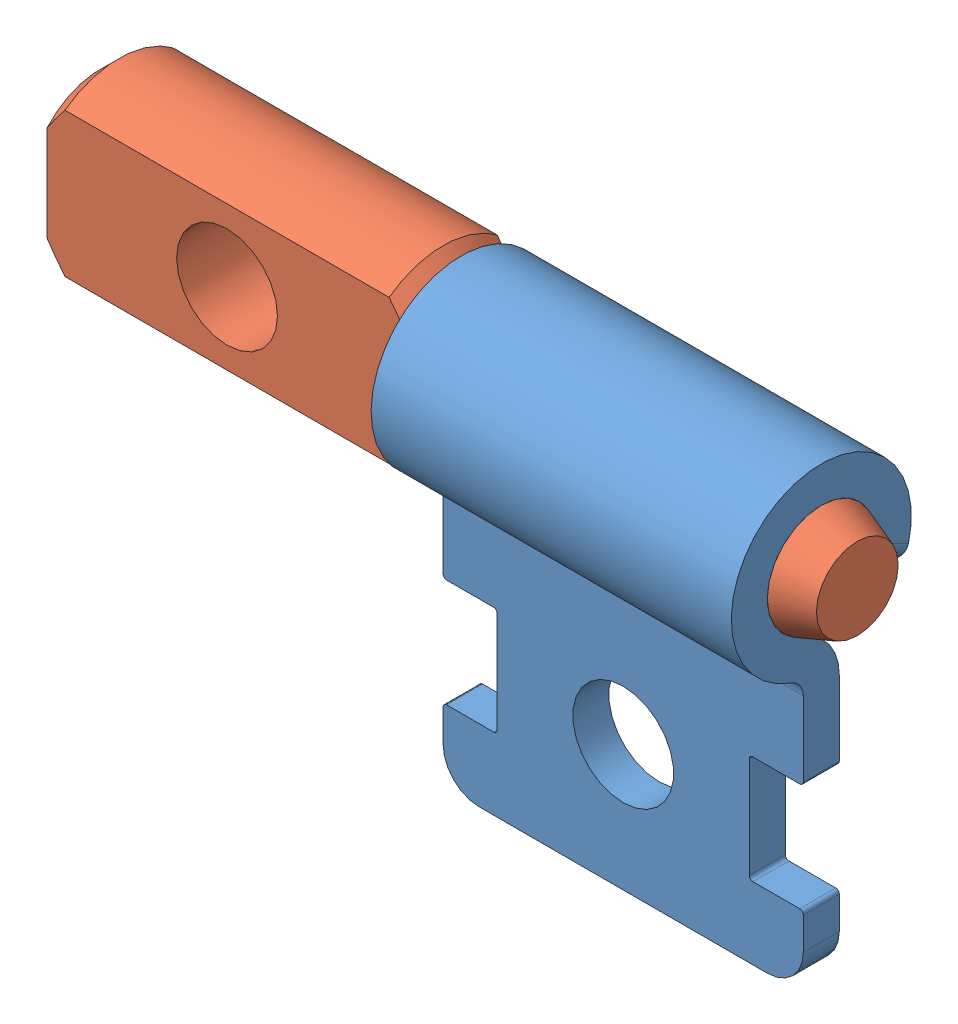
SolidWorks assembly ST040A0.SLDASM, configuration Default (file format 7000). Lengths in mm.
Overall size (21 12.5 5).
2 component instances, 2 part files, 3 mates.
Components (placement in the parent):
- ST040 Bracket-1: ST040 Bracket.SLDPRT [Default] at (-16.2366 7.0676 5.5939) size (10.06 12.5 5)
- ST040A Shaft-2: ST040A Shaft.SLDPRT [ST080B0] at (-26.2366 7.0676 5.5939) size (21 5 3)
Mates (geometry in assembly coordinates):
- Coincident2: coincident anti-aligned: plane of ST040 Bracket-1 through (-16.2366 4.2392 6.5939) normal (-1 0 0); plane of ST040A Shaft-2 through (-16.2366 9.0676 5.5939) normal (1 0 0)
- Concentric2: concentric aligned: cylinder of ST040 Bracket-1 through (-6.2366 7.0676 5.5939) axis (-1 0 0) radius 1.5; cylinder of ST040A Shaft-2 through (-26.2366 7.0676 5.5939) axis (-1 0 0) radius 1.5
- Parallel1: parallel aligned: plane of ST040 Bracket-1 through (-6.2366 4.2392 6.0939) normal (0 0 1); plane of ST040A Shaft-2 through (-7.2366 4.5676 7.0939) normal (0 0 1)
